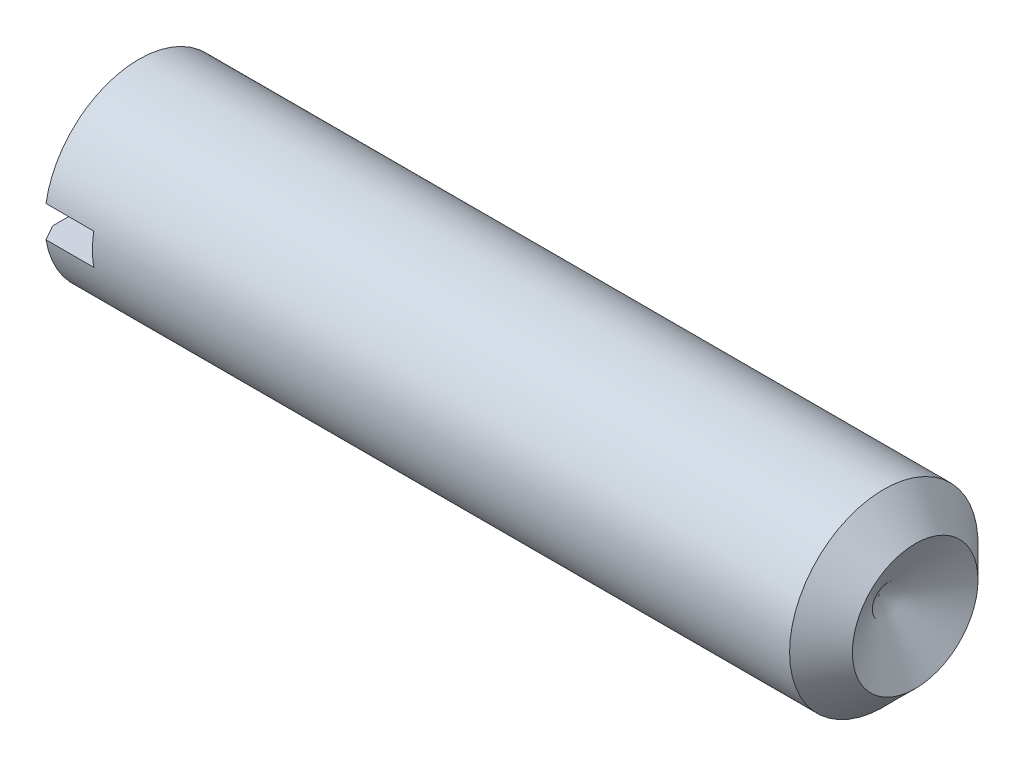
from build123d import *

# Parameters (mm, degrees)
SKETCH2_W  = 12
SKETCH2_H  = 2
SLOT_DEPTH = 3.6


with BuildPart() as part:
    # BodySke → BaseBody (revolve)
    with BuildSketch(Plane.XY, mode=Mode.PRIVATE) as basebody_sk:
        Polygon((50, 4), (47.690598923, 0), (0, 0), (0, 5.036), (0.556565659, 6), (48, 6), align=None)
    revolve(basebody_sk.sketch.rotate(Axis((50, 0, 0), (1, 0, 0)), 90), axis=Axis((50, 0, 0), (1, 0, 0)))

    # Sketch2 → Slot (cut)
    with BuildSketch(Plane(origin=(0, 0, 0), x_dir=(0, 0, -1), z_dir=(1, 0, 0))):
        Rectangle(SKETCH2_W, SKETCH2_H)
    extrude(amount=SLOT_DEPTH, mode=Mode.SUBTRACT)


solid = part.part
